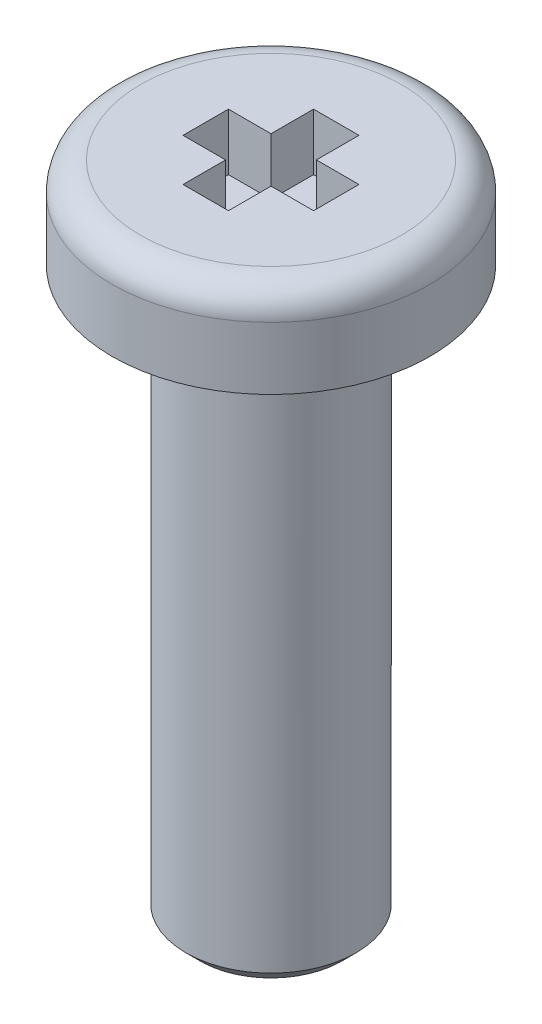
from build123d import *

# Parameters (mm, degrees)
SKETCH2_W               = 0.8
SKETCH2_H               = 2.3
CUT_EXTRUDE_THIN2_DEPTH = 1
CIRPATTERN1_COUNT       = 2
CIRPATTERN1_ANGLE       = 90
SKETCH3_R               = 1.5
BOSS_EXTRUDE1_DEPTH     = 10
FILLET1_R               = 0.2
CHAMFER1_SIZE           = 0.25


with BuildPart() as part:
    # Sketch1 → Base-Revolve (revolve)
    with BuildSketch(Plane.XY, mode=Mode.PRIVATE) as base_revolve_sk:
        with BuildLine():
            Line((2.8, 0), (0, 0))
            Line((0, 0), (0, 1.6))
            Line((0, 1.6), (2.3, 1.6))
            ThreePointArc((2.3, 1.6), (2.653553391, 1.453553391), (2.8, 1.1))
            Line((2.8, 1.1), (2.8, 0))
        make_face()
    revolve(base_revolve_sk.sketch.rotate(Axis((0, 11.592517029, 0), (0, -1, 0)), 90), axis=Axis((0, 11.592517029, 0), (0, -1, 0)))

    # Sketch2 → Cut-Extrude-Thin2 (cut)
    with BuildSketch(Plane(origin=(0, 1.6, 0), x_dir=(-1, 0, 0), z_dir=(0, 1, 0))):
        Rectangle(SKETCH2_W, SKETCH2_H)
    cut_extrude_thin2 = extrude(amount=-CUT_EXTRUDE_THIN2_DEPTH, mode=Mode.SUBTRACT)

    # CirPattern1: Cut-Extrude-Thin2 ×2 about axis
    cirpattern1_axis = Axis((0, 0, 0), (0, 1, 0))
    for i in range(1, CIRPATTERN1_COUNT):
        add(cut_extrude_thin2.rotate(cirpattern1_axis, i * CIRPATTERN1_ANGLE / (CIRPATTERN1_COUNT - 1)), mode=Mode.SUBTRACT)

    # Sketch3 → Boss-Extrude1 (add)
    with BuildSketch(Plane.XZ):
        with Locations(Location((0, 0, 0), (0, 0, 90))):
            Circle(SKETCH3_R)
    extrude(amount=BOSS_EXTRUDE1_DEPTH)

    # Fillet1
    fillet1_edges = [part.edges().sort_by_distance(p)[0] for p in [
        (0, 0, -1.5),
    ]]
    fillet(fillet1_edges, radius=FILLET1_R)

    # Chamfer1
    chamfer1_edges = [part.edges().sort_by_distance(p)[0] for p in [
        (0, -10, -1.5),
    ]]
    chamfer(chamfer1_edges, length=CHAMFER1_SIZE)


solid = part.part
